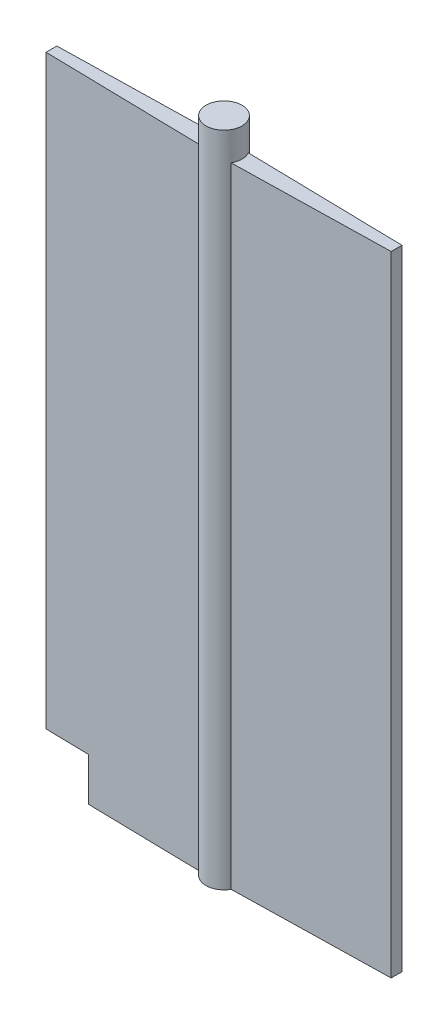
from build123d import *

# Parameters (mm, degrees)
SKETCH1_R               = 6.35
BOSS_EXTRUDE1_DEPTH     = 222.25
SKETCH2_R               = 6.35
BOSS_EXTRUDE2_DEPTH     = 10.16
CUT_EXTRUDE1_DEPTH      = 241.355678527
CUT_EXTRUDE1_DEPTH_BACK = 241.355678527
SKETCH3_W               = 15.24
SKETCH3_H               = 15.24


with BuildPart() as part:
    # Sketch1 → Boss-Extrude1 (new body)
    with BuildSketch(Plane(origin=(0, 0, 0), x_dir=(1, 0, 0), z_dir=(0, 1, 0))):
        Circle(SKETCH1_R)
        Polygon((0, 3.175), (60.96, 1.905), (60.96, -1.905), (0, -3.175), (-60.96, -1.905), (-60.96, 1.905), align=None)
    extrude(amount=BOSS_EXTRUDE1_DEPTH)

    # Sketch2 → Boss-Extrude2 (add)
    with BuildSketch(Plane(origin=(0, 222.25, 0), x_dir=(1, 0, 0), z_dir=(0, 1, 0))):
        with Locations(Location((0, 0, 0), (0, 0, 28.79933441))):
            Circle(SKETCH2_R)
    extrude(amount=BOSS_EXTRUDE2_DEPTH)

    # Sketch3 → Cut-Extrude1 (cut, two sides: drawn at the far end of the back side and taken through both)
    with BuildSketch(Plane.XY.offset(-CUT_EXTRUDE1_DEPTH_BACK)):
        with Locations((-53.34, 7.62)):
            Rectangle(SKETCH3_W, SKETCH3_H)
    extrude(amount=CUT_EXTRUDE1_DEPTH + CUT_EXTRUDE1_DEPTH_BACK, mode=Mode.SUBTRACT)


solid = part.part
